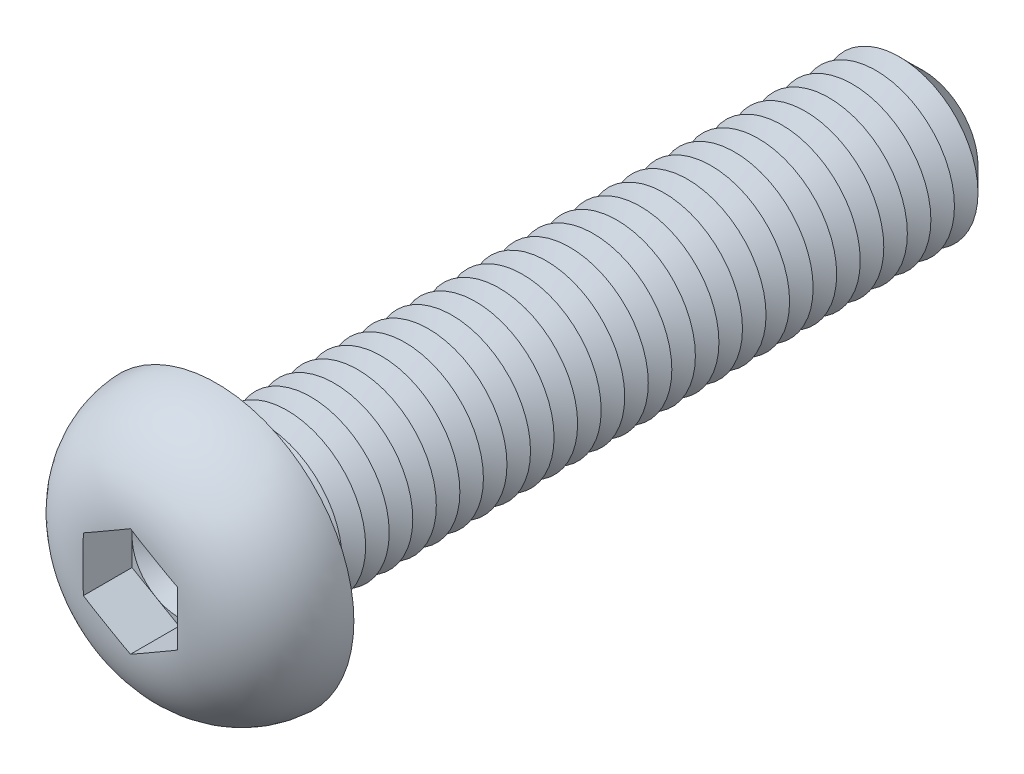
from build123d import *

# Parameters (mm, degrees)
CUT_EXTRUDE1_DEPTH  = 3.12
SKETCH4_R           = 5
BOSS_EXTRUDE1_DEPTH = 45
CHAMFER1_SIZE       = 1.5
LPATTERN1_COUNT     = 28
LPATTERN1_PITCH     = 1.5
FILLET2_R           = 0.6


with BuildPart() as part:
    # Sketch2 → Revolve1 (revolve)
    with BuildSketch(Plane(origin=(0, 0, 0), x_dir=(0, 0, -1), z_dir=(1, 0, 0)), mode=Mode.PRIVATE) as revolve1_sk:
        with BuildLine():
            Line((0, 0), (-5.5, 0))
            Line((-5.5, 0), (-5.5, 2.957763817))
            ThreePointArc((-5.5, 2.957763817), (-3.905948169, 6.951508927), (0, 8.75))
            Line((0, 8.75), (0, 0))
        make_face()
    revolve(revolve1_sk.sketch.rotate(Axis((0, 0, 47.934239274), (0, 0, -1)), 90), axis=Axis((0, 0, 47.934239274), (0, 0, -1)))

    # Sketch3 → Cut-Extrude1 (cut)
    with BuildSketch(Plane.XY.offset(5.5)):
        Polygon((0, 3.464101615), (-3, 1.732050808), (-3, -1.732050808), (0, -3.464101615), (3, -1.732050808), (3, 1.732050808), align=None)
    extrude(amount=-CUT_EXTRUDE1_DEPTH, mode=Mode.SUBTRACT)

    # Sketch4 → Boss-Extrude1 (add)
    with BuildSketch(Plane(origin=(0, 0, 0), x_dir=(-1, 0, 0), z_dir=(0, 0, -1))):
        with Locations(Location((0, 0, 0), (0, 0, 180))):
            Circle(SKETCH4_R)
    extrude(amount=BOSS_EXTRUDE1_DEPTH)

    # Chamfer1
    chamfer1_edges = [part.edges().sort_by_distance(p)[0] for p in [
        (-5, 0, -45),
    ]]
    chamfer(chamfer1_edges, length=CHAMFER1_SIZE)

    # Sketch5 → Cut-Revolve1 (revolve, cut)
    with BuildSketch(Plane(origin=(0, 0, 0), x_dir=(0, 0, -1), z_dir=(1, 0, 0)), mode=Mode.PRIVATE) as cut_revolve1_sk:
        Polygon((1.5, 5), (3, 5), (2.25, 3.700961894), align=None)
    cut_revolve1 = revolve(cut_revolve1_sk.sketch.rotate(Axis((0, 0, 47.934239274), (0, 0, -1)), 90), axis=Axis((0, 0, 47.934239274), (0, 0, -1)), mode=Mode.SUBTRACT)

    # LPattern1: Cut-Revolve1 ×28
    with Locations(*[(0, 0, -i * LPATTERN1_PITCH) for i in range(1, LPATTERN1_COUNT)]):
        add(cut_revolve1, mode=Mode.SUBTRACT)

    # Fillet2
    fillet2_edges = [part.edges().sort_by_distance(p)[0] for p in [
        (-5, 0, 0),
    ]]
    fillet(fillet2_edges, radius=FILLET2_R)

    # Cut-Extrude2 cone 1 section (on through the dimple's axis) → Cut-Extrude2 (revolve, cut)
    with BuildSketch(Plane(origin=(0, 0, 2.38), x_dir=(0, -1, 0), z_dir=(1, 0, 0))):
        Polygon((0, 0), (3, 0), (0, 1.732050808), align=None)
    revolve(axis=Axis((0, 0, 2.38), (0, 0, -1)), mode=Mode.SUBTRACT)


solid = part.part
